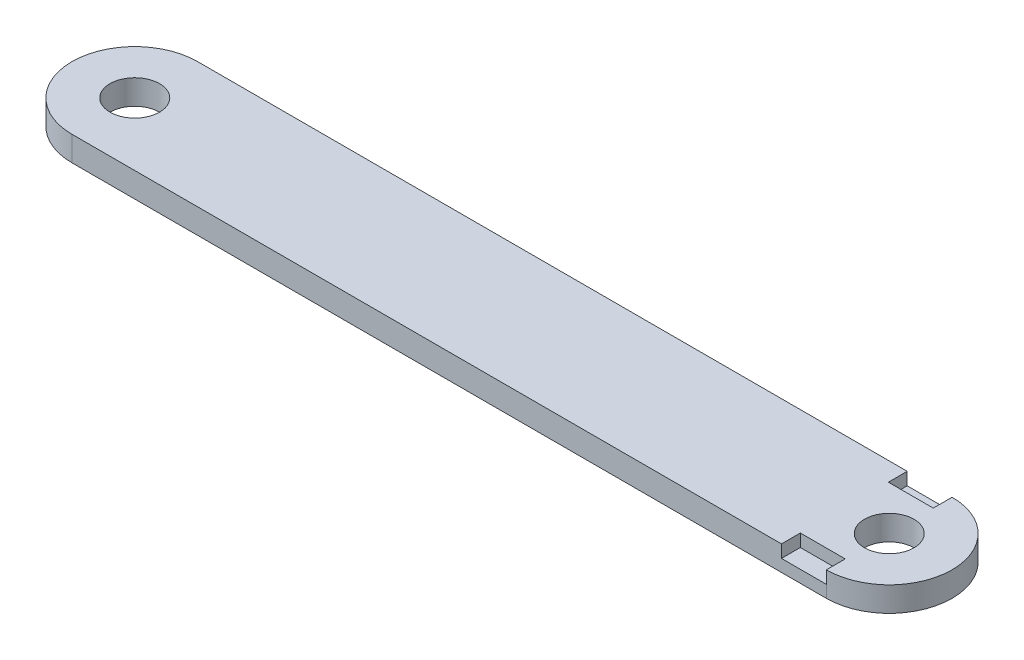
ISO-10303-21;
HEADER;
FILE_DESCRIPTION(('STEP AP214'),'2;1');
FILE_NAME('part.step','',(''),(''),'','','');
FILE_SCHEMA(('AUTOMOTIVE_DESIGN { 1 0 10303 214 1 1 1 1 }'));
ENDSEC;
DATA;
#1=APPLICATION_CONTEXT('core data for automotive mechanical design processes');
#2=APPLICATION_PROTOCOL_DEFINITION('international standard','automotive_design',2000,#1);
#3=PRODUCT_CONTEXT('',#1,'mechanical');
#4=PRODUCT('Part','Part','',(#3));
#5=PRODUCT_RELATED_PRODUCT_CATEGORY('part','',(#4));
#6=PRODUCT_DEFINITION_FORMATION('','',#4);
#7=PRODUCT_DEFINITION_CONTEXT('part definition',#1,'design');
#8=PRODUCT_DEFINITION('design','',#6,#7);
#9=PRODUCT_DEFINITION_SHAPE('','',#8);
#10=(LENGTH_UNIT() NAMED_UNIT(*) SI_UNIT(.MILLI.,.METRE.));
#11=(NAMED_UNIT(*) PLANE_ANGLE_UNIT() SI_UNIT($,.RADIAN.));
#12=(NAMED_UNIT(*) SI_UNIT($,.STERADIAN.) SOLID_ANGLE_UNIT());
#13=UNCERTAINTY_MEASURE_WITH_UNIT(LENGTH_MEASURE(1.E-05),#10,'distance_accuracy_value','');
#14=(GEOMETRIC_REPRESENTATION_CONTEXT(3) GLOBAL_UNCERTAINTY_ASSIGNED_CONTEXT((#13)) GLOBAL_UNIT_ASSIGNED_CONTEXT((#10,
#11,#12)) REPRESENTATION_CONTEXT('',''));
#15=CARTESIAN_POINT('',(0.,0.,0.));
#16=DIRECTION('',(0.,0.,1.));
#17=DIRECTION('',(1.,0.,0.));
#18=AXIS2_PLACEMENT_3D('',#15,#16,#17);
#19=CARTESIAN_POINT('',(-73.5541666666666,5.,1.32291666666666));
#20=DIRECTION('',(0.,-1.,0.));
#21=DIRECTION('',(0.,0.,-1.));
#22=AXIS2_PLACEMENT_3D('',#19,#20,#21);
#23=CYLINDRICAL_SURFACE('',#22,12.7);
#24=CARTESIAN_POINT('',(-73.5541666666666,0.,1.32291666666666));
#25=DIRECTION('',(0.,1.,0.));
#26=DIRECTION('',(0.,0.,-1.));
#27=AXIS2_PLACEMENT_3D('',#24,#25,#26);
#28=CIRCLE('',#27,12.7);
#29=CARTESIAN_POINT('',(-73.5541666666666,0.,-11.3770833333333));
#30=VERTEX_POINT('',#29);
#31=CARTESIAN_POINT('',(-73.5541666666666,0.,14.0229166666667));
#32=VERTEX_POINT('',#31);
#33=EDGE_CURVE('E168',#30,#32,#28,.T.);
#34=ORIENTED_EDGE('',*,*,#33,.T.);
#35=DIRECTION('',(0.,-1.,0.));
#36=VECTOR('',#35,1.);
#37=CARTESIAN_POINT('',(-73.5541666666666,5.,14.0229166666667));
#38=LINE('',#37,#36);
#39=CARTESIAN_POINT('',(-73.5541666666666,5.,14.0229166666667));
#40=VERTEX_POINT('',#39);
#41=EDGE_CURVE('E11',#40,#32,#38,.T.);
#42=ORIENTED_EDGE('',*,*,#41,.F.);
#43=CARTESIAN_POINT('',(-73.5541666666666,5.,1.32291666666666));
#44=DIRECTION('',(0.,1.,0.));
#45=DIRECTION('',(0.,0.,-1.));
#46=AXIS2_PLACEMENT_3D('',#43,#44,#45);
#47=CIRCLE('',#46,12.7);
#48=CARTESIAN_POINT('',(-73.5541666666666,5.,-11.3770833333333));
#49=VERTEX_POINT('',#48);
#50=EDGE_CURVE('E164',#49,#40,#47,.T.);
#51=ORIENTED_EDGE('',*,*,#50,.F.);
#52=DIRECTION('',(0.,-1.,0.));
#53=VECTOR('',#52,1.);
#54=CARTESIAN_POINT('',(-73.5541666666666,5.,-11.3770833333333));
#55=LINE('',#54,#53);
#56=EDGE_CURVE('E161',#49,#30,#55,.T.);
#57=ORIENTED_EDGE('',*,*,#56,.T.);
#58=EDGE_LOOP('',(#34,#42,#51,#57));
#59=FACE_BOUND('',#58,.T.);
#60=ADVANCED_FACE('F33',(#59),#23,.T.);
#61=CARTESIAN_POINT('',(-73.5541666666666,5.,14.0229166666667));
#62=DIRECTION('',(0.,0.,-1.));
#63=DIRECTION('',(-1.,0.,0.));
#64=AXIS2_PLACEMENT_3D('',#61,#62,#63);
#65=PLANE('',#64);
#66=DIRECTION('',(1.,0.,0.));
#67=VECTOR('',#66,1.);
#68=CARTESIAN_POINT('',(78.8458333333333,2.46,14.0229166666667));
#69=LINE('',#68,#67);
#70=CARTESIAN_POINT('',(69.776219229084,2.46,14.0229166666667));
#71=VERTEX_POINT('',#70);
#72=CARTESIAN_POINT('',(78.8458333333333,2.46,14.0229166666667));
#73=VERTEX_POINT('',#72);
#74=EDGE_CURVE('E135',#71,#73,#69,.T.);
#75=ORIENTED_EDGE('',*,*,#74,.F.);
#76=DIRECTION('',(0.,1.,0.));
#77=VECTOR('',#76,1.);
#78=CARTESIAN_POINT('',(69.776219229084,2.46,14.0229166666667));
#79=LINE('',#78,#77);
#80=CARTESIAN_POINT('',(69.776219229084,5.,14.0229166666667));
#81=VERTEX_POINT('',#80);
#82=EDGE_CURVE('E201',#71,#81,#79,.T.);
#83=ORIENTED_EDGE('',*,*,#82,.T.);
#84=DIRECTION('',(1.,0.,0.));
#85=VECTOR('',#84,1.);
#86=CARTESIAN_POINT('',(-73.5541666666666,5.,14.0229166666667));
#87=LINE('',#86,#85);
#88=EDGE_CURVE('E81',#40,#81,#87,.T.);
#89=ORIENTED_EDGE('',*,*,#88,.F.);
#90=ORIENTED_EDGE('',*,*,#41,.T.);
#91=DIRECTION('',(1.,0.,0.));
#92=VECTOR('',#91,1.);
#93=CARTESIAN_POINT('',(-73.5541666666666,0.,14.0229166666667));
#94=LINE('',#93,#92);
#95=CARTESIAN_POINT('',(78.8458333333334,0.,14.0229166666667));
#96=VERTEX_POINT('',#95);
#97=EDGE_CURVE('E148',#32,#96,#94,.T.);
#98=ORIENTED_EDGE('',*,*,#97,.T.);
#99=DIRECTION('',(0.,-1.,0.));
#100=VECTOR('',#99,1.);
#101=CARTESIAN_POINT('',(78.8458333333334,5.,14.0229166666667));
#102=LINE('',#101,#100);
#103=EDGE_CURVE('E146',#73,#96,#102,.T.);
#104=ORIENTED_EDGE('',*,*,#103,.F.);
#105=EDGE_LOOP('',(#75,#83,#89,#90,#98,#104));
#106=FACE_BOUND('',#105,.T.);
#107=ADVANCED_FACE('F147',(#106),#65,.F.);
#108=CARTESIAN_POINT('',(78.8458333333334,5.,1.32291666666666));
#109=DIRECTION('',(0.,-1.,0.));
#110=DIRECTION('',(0.,0.,-1.));
#111=AXIS2_PLACEMENT_3D('',#108,#109,#110);
#112=CYLINDRICAL_SURFACE('',#111,12.7);
#113=CARTESIAN_POINT('',(78.8458333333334,0.,1.32291666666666));
#114=DIRECTION('',(0.,1.,0.));
#115=DIRECTION('',(0.,0.,-1.));
#116=AXIS2_PLACEMENT_3D('',#113,#114,#115);
#117=CIRCLE('',#116,12.7);
#118=CARTESIAN_POINT('',(78.8458333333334,0.,-11.3770833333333));
#119=VERTEX_POINT('',#118);
#120=EDGE_CURVE('E165',#96,#119,#117,.T.);
#121=ORIENTED_EDGE('',*,*,#120,.T.);
#122=DIRECTION('',(0.,-1.,0.));
#123=VECTOR('',#122,1.);
#124=CARTESIAN_POINT('',(78.8458333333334,5.,-11.3770833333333));
#125=LINE('',#124,#123);
#126=CARTESIAN_POINT('',(78.8458333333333,2.46,-11.3770833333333));
#127=VERTEX_POINT('',#126);
#128=EDGE_CURVE('E160',#127,#119,#125,.T.);
#129=ORIENTED_EDGE('',*,*,#128,.F.);
#130=CARTESIAN_POINT('',(78.8458333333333,5.,-11.3770833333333));
#131=VERTEX_POINT('',#130);
#132=EDGE_CURVE('E152',#131,#127,#125,.T.);
#133=ORIENTED_EDGE('',*,*,#132,.F.);
#134=CARTESIAN_POINT('',(78.8458333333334,5.,1.32291666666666));
#135=DIRECTION('',(0.,1.,0.));
#136=DIRECTION('',(0.,0.,-1.));
#137=AXIS2_PLACEMENT_3D('',#134,#135,#136);
#138=CIRCLE('',#137,12.7);
#139=CARTESIAN_POINT('',(78.8458333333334,5.,14.0229166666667));
#140=VERTEX_POINT('',#139);
#141=EDGE_CURVE('E157',#140,#131,#138,.T.);
#142=ORIENTED_EDGE('',*,*,#141,.F.);
#143=EDGE_CURVE('E40',#140,#73,#102,.T.);
#144=ORIENTED_EDGE('',*,*,#143,.T.);
#145=ORIENTED_EDGE('',*,*,#103,.T.);
#146=EDGE_LOOP('',(#121,#129,#133,#142,#144,#145));
#147=FACE_BOUND('',#146,.T.);
#148=ADVANCED_FACE('F154',(#147),#112,.T.);
#149=CARTESIAN_POINT('',(-73.5541666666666,5.,-11.3770833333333));
#150=DIRECTION('',(0.,0.,1.));
#151=DIRECTION('',(1.,0.,0.));
#152=AXIS2_PLACEMENT_3D('',#149,#150,#151);
#153=PLANE('',#152);
#154=DIRECTION('',(-1.,0.,0.));
#155=VECTOR('',#154,1.);
#156=CARTESIAN_POINT('',(-73.5541666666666,5.,-11.3770833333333));
#157=LINE('',#156,#155);
#158=CARTESIAN_POINT('',(69.7762192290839,5.,-11.3770833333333));
#159=VERTEX_POINT('',#158);
#160=EDGE_CURVE('E55',#159,#49,#157,.T.);
#161=ORIENTED_EDGE('',*,*,#160,.F.);
#162=DIRECTION('',(0.,1.,0.));
#163=VECTOR('',#162,1.);
#164=CARTESIAN_POINT('',(69.776219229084,2.46,-11.3770833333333));
#165=LINE('',#164,#163);
#166=CARTESIAN_POINT('',(69.776219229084,2.46,-11.3770833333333));
#167=VERTEX_POINT('',#166);
#168=EDGE_CURVE('E47',#167,#159,#165,.T.);
#169=ORIENTED_EDGE('',*,*,#168,.F.);
#170=DIRECTION('',(-1.,0.,0.));
#171=VECTOR('',#170,1.);
#172=CARTESIAN_POINT('',(78.8458333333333,2.46,-11.3770833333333));
#173=LINE('',#172,#171);
#174=EDGE_CURVE('E207',#127,#167,#173,.T.);
#175=ORIENTED_EDGE('',*,*,#174,.F.);
#176=ORIENTED_EDGE('',*,*,#128,.T.);
#177=DIRECTION('',(-1.,0.,0.));
#178=VECTOR('',#177,1.);
#179=CARTESIAN_POINT('',(-73.5541666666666,0.,-11.3770833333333));
#180=LINE('',#179,#178);
#181=EDGE_CURVE('E75',#119,#30,#180,.T.);
#182=ORIENTED_EDGE('',*,*,#181,.T.);
#183=ORIENTED_EDGE('',*,*,#56,.F.);
#184=EDGE_LOOP('',(#161,#169,#175,#176,#182,#183));
#185=FACE_BOUND('',#184,.T.);
#186=ADVANCED_FACE('F237',(#185),#153,.F.);
#187=CARTESIAN_POINT('',(-73.5541666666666,5.,1.32291666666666));
#188=DIRECTION('',(0.,-1.,0.));
#189=DIRECTION('',(0.,0.,-1.));
#190=AXIS2_PLACEMENT_3D('',#187,#188,#189);
#191=PLANE('',#190);
#192=CARTESIAN_POINT('',(78.8458333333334,5.,1.32291666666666));
#193=DIRECTION('',(0.,1.,0.));
#194=DIRECTION('',(0.,0.,1.));
#195=AXIS2_PLACEMENT_3D('',#192,#193,#194);
#196=CIRCLE('',#195,5.);
#197=CARTESIAN_POINT('',(78.8458333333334,5.,6.32291666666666));
#198=VERTEX_POINT('',#197);
#199=EDGE_CURVE('E179',#198,#198,#196,.T.);
#200=ORIENTED_EDGE('',*,*,#199,.F.);
#201=EDGE_LOOP('',(#200));
#202=FACE_BOUND('',#201,.T.);
#203=CARTESIAN_POINT('',(-73.5541666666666,5.,1.32291666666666));
#204=DIRECTION('',(0.,1.,0.));
#205=DIRECTION('',(0.,0.,1.));
#206=AXIS2_PLACEMENT_3D('',#203,#204,#205);
#207=CIRCLE('',#206,5.);
#208=CARTESIAN_POINT('',(-73.5541666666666,5.,6.32291666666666));
#209=VERTEX_POINT('',#208);
#210=EDGE_CURVE('E171',#209,#209,#207,.T.);
#211=ORIENTED_EDGE('',*,*,#210,.F.);
#212=EDGE_LOOP('',(#211));
#213=FACE_BOUND('',#212,.T.);
#214=ORIENTED_EDGE('',*,*,#88,.T.);
#215=DIRECTION('',(0.,0.,1.));
#216=VECTOR('',#215,1.);
#217=CARTESIAN_POINT('',(69.776219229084,5.,14.0229166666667));
#218=LINE('',#217,#216);
#219=CARTESIAN_POINT('',(69.776219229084,5.,10.2129166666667));
#220=VERTEX_POINT('',#219);
#221=EDGE_CURVE('E143',#220,#81,#218,.T.);
#222=ORIENTED_EDGE('',*,*,#221,.F.);
#223=DIRECTION('',(-1.,0.,0.));
#224=VECTOR('',#223,1.);
#225=CARTESIAN_POINT('',(78.8458333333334,5.,10.2129166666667));
#226=LINE('',#225,#224);
#227=CARTESIAN_POINT('',(78.8458333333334,5.,10.2129166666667));
#228=VERTEX_POINT('',#227);
#229=EDGE_CURVE('E217',#228,#220,#226,.T.);
#230=ORIENTED_EDGE('',*,*,#229,.F.);
#231=DIRECTION('',(0.,0.,-1.));
#232=VECTOR('',#231,1.);
#233=CARTESIAN_POINT('',(78.8458333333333,5.,14.0229166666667));
#234=LINE('',#233,#232);
#235=EDGE_CURVE('E220',#140,#228,#234,.T.);
#236=ORIENTED_EDGE('',*,*,#235,.F.);
#237=ORIENTED_EDGE('',*,*,#141,.T.);
#238=DIRECTION('',(0.,0.,-1.));
#239=VECTOR('',#238,1.);
#240=CARTESIAN_POINT('',(78.8458333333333,5.,-11.3770833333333));
#241=LINE('',#240,#239);
#242=CARTESIAN_POINT('',(78.8458333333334,5.,-7.56708333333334));
#243=VERTEX_POINT('',#242);
#244=EDGE_CURVE('E199',#243,#131,#241,.T.);
#245=ORIENTED_EDGE('',*,*,#244,.F.);
#246=DIRECTION('',(1.,0.,0.));
#247=VECTOR('',#246,1.);
#248=CARTESIAN_POINT('',(78.8458333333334,5.,-7.56708333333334));
#249=LINE('',#248,#247);
#250=CARTESIAN_POINT('',(69.776219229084,5.,-7.56708333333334));
#251=VERTEX_POINT('',#250);
#252=EDGE_CURVE('E193',#251,#243,#249,.T.);
#253=ORIENTED_EDGE('',*,*,#252,.F.);
#254=DIRECTION('',(0.,0.,1.));
#255=VECTOR('',#254,1.);
#256=CARTESIAN_POINT('',(69.776219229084,5.,-11.3770833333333));
#257=LINE('',#256,#255);
#258=EDGE_CURVE('E197',#159,#251,#257,.T.);
#259=ORIENTED_EDGE('',*,*,#258,.F.);
#260=ORIENTED_EDGE('',*,*,#160,.T.);
#261=ORIENTED_EDGE('',*,*,#50,.T.);
#262=EDGE_LOOP('',(#214,#222,#230,#236,#237,#245,#253,#259,#260,#261));
#263=FACE_BOUND('',#262,.T.);
#264=ADVANCED_FACE('F227',(#202,#213,#263),#191,.F.);
#265=CARTESIAN_POINT('',(-73.5541666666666,0.,1.32291666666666));
#266=DIRECTION('',(0.,-1.,0.));
#267=DIRECTION('',(0.,0.,-1.));
#268=AXIS2_PLACEMENT_3D('',#265,#266,#267);
#269=PLANE('',#268);
#270=CARTESIAN_POINT('',(78.8458333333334,0.,1.32291666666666));
#271=DIRECTION('',(0.,1.,0.));
#272=DIRECTION('',(0.,0.,1.));
#273=AXIS2_PLACEMENT_3D('',#270,#271,#272);
#274=CIRCLE('',#273,5.);
#275=CARTESIAN_POINT('',(78.8458333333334,0.,6.32291666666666));
#276=VERTEX_POINT('',#275);
#277=EDGE_CURVE('E182',#276,#276,#274,.T.);
#278=ORIENTED_EDGE('',*,*,#277,.T.);
#279=EDGE_LOOP('',(#278));
#280=FACE_BOUND('',#279,.T.);
#281=CARTESIAN_POINT('',(-73.5541666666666,0.,1.32291666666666));
#282=DIRECTION('',(0.,1.,0.));
#283=DIRECTION('',(0.,0.,1.));
#284=AXIS2_PLACEMENT_3D('',#281,#282,#283);
#285=CIRCLE('',#284,5.);
#286=CARTESIAN_POINT('',(-73.5541666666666,0.,6.32291666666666));
#287=VERTEX_POINT('',#286);
#288=EDGE_CURVE('E176',#287,#287,#285,.T.);
#289=ORIENTED_EDGE('',*,*,#288,.T.);
#290=EDGE_LOOP('',(#289));
#291=FACE_BOUND('',#290,.T.);
#292=ORIENTED_EDGE('',*,*,#33,.F.);
#293=ORIENTED_EDGE('',*,*,#181,.F.);
#294=ORIENTED_EDGE('',*,*,#120,.F.);
#295=ORIENTED_EDGE('',*,*,#97,.F.);
#296=EDGE_LOOP('',(#292,#293,#294,#295));
#297=FACE_BOUND('',#296,.T.);
#298=ADVANCED_FACE('F234',(#280,#291,#297),#269,.T.);
#299=CARTESIAN_POINT('',(-73.5541666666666,5.,1.32291666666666));
#300=DIRECTION('',(0.,-1.,0.));
#301=DIRECTION('',(0.,0.,-1.));
#302=AXIS2_PLACEMENT_3D('',#299,#300,#301);
#303=CYLINDRICAL_SURFACE('',#302,5.);
#304=ORIENTED_EDGE('',*,*,#210,.T.);
#305=EDGE_LOOP('',(#304));
#306=FACE_BOUND('',#305,.T.);
#307=ORIENTED_EDGE('',*,*,#288,.F.);
#308=EDGE_LOOP('',(#307));
#309=FACE_BOUND('',#308,.T.);
#310=ADVANCED_FACE('F269',(#306,#309),#303,.F.);
#311=CARTESIAN_POINT('',(78.8458333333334,5.,1.32291666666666));
#312=DIRECTION('',(0.,-1.,0.));
#313=DIRECTION('',(0.,0.,-1.));
#314=AXIS2_PLACEMENT_3D('',#311,#312,#313);
#315=CYLINDRICAL_SURFACE('',#314,5.);
#316=ORIENTED_EDGE('',*,*,#199,.T.);
#317=EDGE_LOOP('',(#316));
#318=FACE_BOUND('',#317,.T.);
#319=ORIENTED_EDGE('',*,*,#277,.F.);
#320=EDGE_LOOP('',(#319));
#321=FACE_BOUND('',#320,.T.);
#322=ADVANCED_FACE('F276',(#318,#321),#315,.F.);
#323=CARTESIAN_POINT('',(78.8458333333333,2.46,-11.3770833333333));
#324=DIRECTION('',(1.,0.,0.));
#325=DIRECTION('',(0.,0.,-1.));
#326=AXIS2_PLACEMENT_3D('',#323,#324,#325);
#327=PLANE('',#326);
#328=ORIENTED_EDGE('',*,*,#244,.T.);
#329=ORIENTED_EDGE('',*,*,#132,.T.);
#330=DIRECTION('',(0.,0.,-1.));
#331=VECTOR('',#330,1.);
#332=CARTESIAN_POINT('',(78.8458333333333,2.46,-11.3770833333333));
#333=LINE('',#332,#331);
#334=CARTESIAN_POINT('',(78.8458333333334,2.46,-7.56708333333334));
#335=VERTEX_POINT('',#334);
#336=EDGE_CURVE('E196',#335,#127,#333,.T.);
#337=ORIENTED_EDGE('',*,*,#336,.F.);
#338=DIRECTION('',(0.,1.,0.));
#339=VECTOR('',#338,1.);
#340=CARTESIAN_POINT('',(78.8458333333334,2.46,-7.56708333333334));
#341=LINE('',#340,#339);
#342=EDGE_CURVE('E185',#335,#243,#341,.T.);
#343=ORIENTED_EDGE('',*,*,#342,.T.);
#344=EDGE_LOOP('',(#328,#329,#337,#343));
#345=FACE_BOUND('',#344,.T.);
#346=ADVANCED_FACE('F243',(#345),#327,.F.);
#347=CARTESIAN_POINT('',(78.8458333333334,2.46,-7.56708333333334));
#348=DIRECTION('',(0.,0.,1.));
#349=DIRECTION('',(1.,0.,0.));
#350=AXIS2_PLACEMENT_3D('',#347,#348,#349);
#351=PLANE('',#350);
#352=ORIENTED_EDGE('',*,*,#252,.T.);
#353=ORIENTED_EDGE('',*,*,#342,.F.);
#354=DIRECTION('',(1.,0.,0.));
#355=VECTOR('',#354,1.);
#356=CARTESIAN_POINT('',(78.8458333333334,2.46,-7.56708333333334));
#357=LINE('',#356,#355);
#358=CARTESIAN_POINT('',(69.776219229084,2.46,-7.56708333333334));
#359=VERTEX_POINT('',#358);
#360=EDGE_CURVE('E190',#359,#335,#357,.T.);
#361=ORIENTED_EDGE('',*,*,#360,.F.);
#362=DIRECTION('',(0.,1.,0.));
#363=VECTOR('',#362,1.);
#364=CARTESIAN_POINT('',(69.776219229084,2.46,-7.56708333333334));
#365=LINE('',#364,#363);
#366=EDGE_CURVE('E189',#359,#251,#365,.T.);
#367=ORIENTED_EDGE('',*,*,#366,.T.);
#368=EDGE_LOOP('',(#352,#353,#361,#367));
#369=FACE_BOUND('',#368,.T.);
#370=ADVANCED_FACE('F283',(#369),#351,.F.);
#371=CARTESIAN_POINT('',(69.776219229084,2.46,-11.3770833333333));
#372=DIRECTION('',(-1.,0.,0.));
#373=DIRECTION('',(0.,0.,1.));
#374=AXIS2_PLACEMENT_3D('',#371,#372,#373);
#375=PLANE('',#374);
#376=ORIENTED_EDGE('',*,*,#258,.T.);
#377=ORIENTED_EDGE('',*,*,#366,.F.);
#378=DIRECTION('',(0.,0.,1.));
#379=VECTOR('',#378,1.);
#380=CARTESIAN_POINT('',(69.776219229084,2.46,-11.3770833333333));
#381=LINE('',#380,#379);
#382=EDGE_CURVE('E204',#167,#359,#381,.T.);
#383=ORIENTED_EDGE('',*,*,#382,.F.);
#384=ORIENTED_EDGE('',*,*,#168,.T.);
#385=EDGE_LOOP('',(#376,#377,#383,#384));
#386=FACE_BOUND('',#385,.T.);
#387=ADVANCED_FACE('F284',(#386),#375,.F.);
#388=CARTESIAN_POINT('',(0.,2.46,0.));
#389=DIRECTION('',(0.,-1.,0.));
#390=DIRECTION('',(0.,0.,-1.));
#391=AXIS2_PLACEMENT_3D('',#388,#389,#390);
#392=PLANE('',#391);
#393=ORIENTED_EDGE('',*,*,#336,.T.);
#394=ORIENTED_EDGE('',*,*,#174,.T.);
#395=ORIENTED_EDGE('',*,*,#382,.T.);
#396=ORIENTED_EDGE('',*,*,#360,.T.);
#397=EDGE_LOOP('',(#393,#394,#395,#396));
#398=FACE_BOUND('',#397,.T.);
#399=ADVANCED_FACE('F239',(#398),#392,.F.);
#400=CARTESIAN_POINT('',(69.776219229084,2.46,14.0229166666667));
#401=DIRECTION('',(-1.,0.,0.));
#402=DIRECTION('',(0.,0.,1.));
#403=AXIS2_PLACEMENT_3D('',#400,#401,#402);
#404=PLANE('',#403);
#405=ORIENTED_EDGE('',*,*,#221,.T.);
#406=ORIENTED_EDGE('',*,*,#82,.F.);
#407=DIRECTION('',(0.,0.,1.));
#408=VECTOR('',#407,1.);
#409=CARTESIAN_POINT('',(69.776219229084,2.46,14.0229166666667));
#410=LINE('',#409,#408);
#411=CARTESIAN_POINT('',(69.776219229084,2.46,10.2129166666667));
#412=VERTEX_POINT('',#411);
#413=EDGE_CURVE('E142',#412,#71,#410,.T.);
#414=ORIENTED_EDGE('',*,*,#413,.F.);
#415=DIRECTION('',(0.,1.,0.));
#416=VECTOR('',#415,1.);
#417=CARTESIAN_POINT('',(69.776219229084,2.46,10.2129166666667));
#418=LINE('',#417,#416);
#419=EDGE_CURVE('E213',#412,#220,#418,.T.);
#420=ORIENTED_EDGE('',*,*,#419,.T.);
#421=EDGE_LOOP('',(#405,#406,#414,#420));
#422=FACE_BOUND('',#421,.T.);
#423=ADVANCED_FACE('F225',(#422),#404,.F.);
#424=CARTESIAN_POINT('',(78.8458333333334,2.46,10.2129166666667));
#425=DIRECTION('',(0.,0.,-1.));
#426=DIRECTION('',(-1.,0.,0.));
#427=AXIS2_PLACEMENT_3D('',#424,#425,#426);
#428=PLANE('',#427);
#429=ORIENTED_EDGE('',*,*,#229,.T.);
#430=ORIENTED_EDGE('',*,*,#419,.F.);
#431=DIRECTION('',(-1.,0.,0.));
#432=VECTOR('',#431,1.);
#433=CARTESIAN_POINT('',(78.8458333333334,2.46,10.2129166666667));
#434=LINE('',#433,#432);
#435=CARTESIAN_POINT('',(78.8458333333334,2.46,10.2129166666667));
#436=VERTEX_POINT('',#435);
#437=EDGE_CURVE('E134',#436,#412,#434,.T.);
#438=ORIENTED_EDGE('',*,*,#437,.F.);
#439=DIRECTION('',(0.,1.,0.));
#440=VECTOR('',#439,1.);
#441=CARTESIAN_POINT('',(78.8458333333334,2.46,10.2129166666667));
#442=LINE('',#441,#440);
#443=EDGE_CURVE('E130',#436,#228,#442,.T.);
#444=ORIENTED_EDGE('',*,*,#443,.T.);
#445=EDGE_LOOP('',(#429,#430,#438,#444));
#446=FACE_BOUND('',#445,.T.);
#447=ADVANCED_FACE('F246',(#446),#428,.F.);
#448=CARTESIAN_POINT('',(78.8458333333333,2.46,14.0229166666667));
#449=DIRECTION('',(1.,0.,0.));
#450=DIRECTION('',(0.,0.,-1.));
#451=AXIS2_PLACEMENT_3D('',#448,#449,#450);
#452=PLANE('',#451);
#453=ORIENTED_EDGE('',*,*,#235,.T.);
#454=ORIENTED_EDGE('',*,*,#443,.F.);
#455=DIRECTION('',(0.,0.,-1.));
#456=VECTOR('',#455,1.);
#457=CARTESIAN_POINT('',(78.8458333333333,2.46,14.0229166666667));
#458=LINE('',#457,#456);
#459=EDGE_CURVE('E124',#73,#436,#458,.T.);
#460=ORIENTED_EDGE('',*,*,#459,.F.);
#461=ORIENTED_EDGE('',*,*,#143,.F.);
#462=EDGE_LOOP('',(#453,#454,#460,#461));
#463=FACE_BOUND('',#462,.T.);
#464=ADVANCED_FACE('F127',(#463),#452,.F.);
#465=CARTESIAN_POINT('',(0.,2.46,0.));
#466=DIRECTION('',(0.,-1.,0.));
#467=DIRECTION('',(0.,0.,-1.));
#468=AXIS2_PLACEMENT_3D('',#465,#466,#467);
#469=PLANE('',#468);
#470=ORIENTED_EDGE('',*,*,#74,.T.);
#471=ORIENTED_EDGE('',*,*,#459,.T.);
#472=ORIENTED_EDGE('',*,*,#437,.T.);
#473=ORIENTED_EDGE('',*,*,#413,.T.);
#474=EDGE_LOOP('',(#470,#471,#472,#473));
#475=FACE_BOUND('',#474,.T.);
#476=ADVANCED_FACE('F140',(#475),#469,.F.);
#477=CLOSED_SHELL('',(#60,#107,#148,#186,#264,#298,#310,#322,#346,#370,#387,#399,#423,#447,#464,#476));
#478=MANIFOLD_SOLID_BREP('B2',#477);
#479=ADVANCED_BREP_SHAPE_REPRESENTATION('',(#18,#478),#14);
#480=SHAPE_DEFINITION_REPRESENTATION(#9,#479);
ENDSEC;
END-ISO-10303-21;
